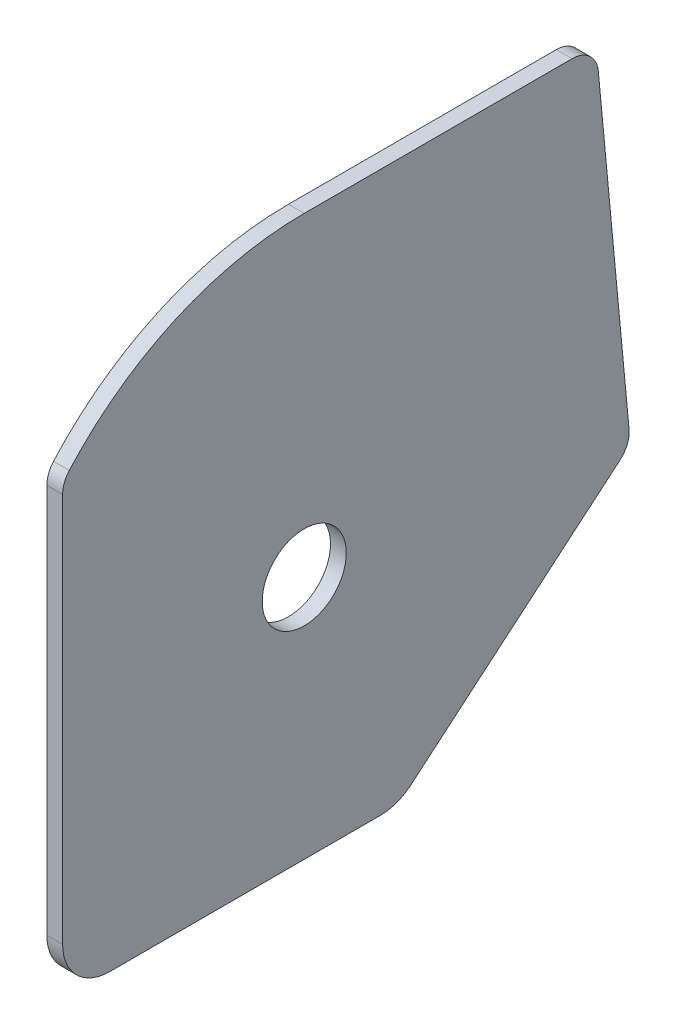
from build123d import *

# Parameters (mm, degrees)
ESQUISSE1_R      = 8
EXTRUSION1_DEPTH = 3


with BuildPart() as part:
    # Esquisse1 → Extrusion1 (new body)
    with BuildSketch(Plane(origin=(0, 0, 0), x_dir=(0, 0, -1), z_dir=(1, 0, 0))):
        with BuildLine():
            Line((-46, 36.66060556), (-46, -37.5))
            ThreePointArc((-46, -37.5), (-43.363961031, -43.863961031), (-37, -46.5))
            Line((-37, -46.5), (14.5, -46.5))
            ThreePointArc((14.5, -46.5), (17.592937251, -45.951848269), (20.30911919, -44.374164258))
            Line((20.30911919, -44.374164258), (60.082710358, -10.762873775))
            ThreePointArc((60.082710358, -10.762873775), (61.484774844, -8.833097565), (61.833231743, -6.473352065))
            Line((61.833231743, -6.473352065), (55.977809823, 55.470541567))
            ThreePointArc((55.977809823, 55.470541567), (54.365062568, 58.698155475), (51, 60))
            Line((51, 60), (0, 60))
            ThreePointArc((0, 60), (-24.498946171, 54.770444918), (-44.727272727, 39.993387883))
            ThreePointArc((-44.727272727, 39.993387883), (-45.670993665, 38.44437073), (-46, 36.66060556))
        make_face()
        Circle(ESQUISSE1_R, mode=Mode.SUBTRACT)
    extrude(amount=EXTRUSION1_DEPTH)


solid = part.part
